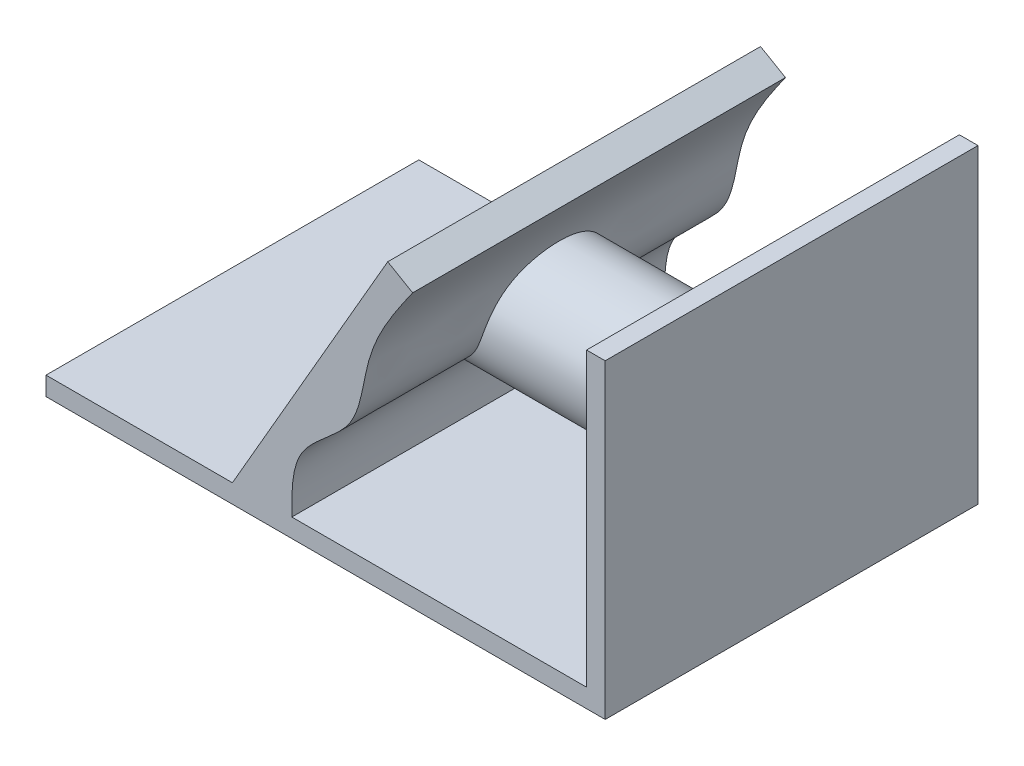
ISO-10303-21;
HEADER;
FILE_DESCRIPTION(('STEP AP214'),'2;1');
FILE_NAME('part.step','',(''),(''),'','','');
FILE_SCHEMA(('AUTOMOTIVE_DESIGN { 1 0 10303 214 1 1 1 1 }'));
ENDSEC;
DATA;
#1=APPLICATION_CONTEXT('core data for automotive mechanical design processes');
#2=APPLICATION_PROTOCOL_DEFINITION('international standard','automotive_design',2000,#1);
#3=PRODUCT_CONTEXT('',#1,'mechanical');
#4=PRODUCT('Part','Part','',(#3));
#5=PRODUCT_RELATED_PRODUCT_CATEGORY('part','',(#4));
#6=PRODUCT_DEFINITION_FORMATION('','',#4);
#7=PRODUCT_DEFINITION_CONTEXT('part definition',#1,'design');
#8=PRODUCT_DEFINITION('design','',#6,#7);
#9=PRODUCT_DEFINITION_SHAPE('','',#8);
#10=(LENGTH_UNIT() NAMED_UNIT(*) SI_UNIT(.MILLI.,.METRE.));
#11=(NAMED_UNIT(*) PLANE_ANGLE_UNIT() SI_UNIT($,.RADIAN.));
#12=(NAMED_UNIT(*) SI_UNIT($,.STERADIAN.) SOLID_ANGLE_UNIT());
#13=UNCERTAINTY_MEASURE_WITH_UNIT(LENGTH_MEASURE(1.E-05),#10,'distance_accuracy_value','');
#14=(GEOMETRIC_REPRESENTATION_CONTEXT(3) GLOBAL_UNCERTAINTY_ASSIGNED_CONTEXT((#13)) GLOBAL_UNIT_ASSIGNED_CONTEXT((#10,
#11,#12)) REPRESENTATION_CONTEXT('',''));
#15=CARTESIAN_POINT('',(0.,0.,0.));
#16=DIRECTION('',(0.,0.,1.));
#17=DIRECTION('',(1.,0.,0.));
#18=AXIS2_PLACEMENT_3D('',#15,#16,#17);
#19=CARTESIAN_POINT('',(-3.,0.,30.));
#20=DIRECTION('',(-1.,0.,0.));
#21=DIRECTION('',(0.,0.,1.));
#22=AXIS2_PLACEMENT_3D('',#19,#20,#21);
#23=PLANE('',#22);
#24=DIRECTION('',(0.,1.,0.));
#25=VECTOR('',#24,1.);
#26=CARTESIAN_POINT('',(-3.,0.,-30.));
#27=LINE('',#26,#25);
#28=CARTESIAN_POINT('',(-3.,3.,-30.));
#29=VERTEX_POINT('',#28);
#30=CARTESIAN_POINT('',(-3.,50.,-30.));
#31=VERTEX_POINT('',#30);
#32=EDGE_CURVE('E193',#29,#31,#27,.T.);
#33=ORIENTED_EDGE('',*,*,#32,.F.);
#34=DIRECTION('',(0.,0.,-1.));
#35=VECTOR('',#34,1.);
#36=CARTESIAN_POINT('',(-3.,3.,30.));
#37=LINE('',#36,#35);
#38=CARTESIAN_POINT('',(-3.,3.,30.));
#39=VERTEX_POINT('',#38);
#40=EDGE_CURVE('E232',#39,#29,#37,.T.);
#41=ORIENTED_EDGE('',*,*,#40,.F.);
#42=DIRECTION('',(0.,1.,0.));
#43=VECTOR('',#42,1.);
#44=CARTESIAN_POINT('',(-3.,0.,30.));
#45=LINE('',#44,#43);
#46=CARTESIAN_POINT('',(-3.,50.,30.));
#47=VERTEX_POINT('',#46);
#48=EDGE_CURVE('E214',#39,#47,#45,.T.);
#49=ORIENTED_EDGE('',*,*,#48,.T.);
#50=DIRECTION('',(0.,0.,-1.));
#51=VECTOR('',#50,1.);
#52=CARTESIAN_POINT('',(-3.,50.,30.));
#53=LINE('',#52,#51);
#54=EDGE_CURVE('E189',#47,#31,#53,.T.);
#55=ORIENTED_EDGE('',*,*,#54,.T.);
#56=EDGE_LOOP('',(#33,#41,#49,#55));
#57=FACE_BOUND('',#56,.T.);
#58=CARTESIAN_POINT('',(-3.,23.,0.));
#59=DIRECTION('',(-1.,0.,0.));
#60=DIRECTION('',(0.,0.,1.));
#61=AXIS2_PLACEMENT_3D('',#58,#59,#60);
#62=CIRCLE('',#61,10.);
#63=CARTESIAN_POINT('',(-3.,23.,10.));
#64=VERTEX_POINT('',#63);
#65=EDGE_CURVE('E123',#64,#64,#62,.T.);
#66=ORIENTED_EDGE('',*,*,#65,.F.);
#67=EDGE_LOOP('',(#66));
#68=FACE_BOUND('',#67,.T.);
#69=ADVANCED_FACE('F33',(#57,#68),#23,.T.);
#70=CARTESIAN_POINT('',(-50.4341854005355,2.99999999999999,30.));
#71=CARTESIAN_POINT('',(-50.4607532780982,6.44708036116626,30.));
#72=CARTESIAN_POINT('',(-50.5185122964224,13.9410917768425,30.));
#73=CARTESIAN_POINT('',(-39.3840702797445,19.5912058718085,30.));
#74=CARTESIAN_POINT('',(-38.7683295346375,32.8752846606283,30.));
#75=CARTESIAN_POINT('',(-33.8355964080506,39.9154113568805,30.));
#76=CARTESIAN_POINT('',(-30.9853236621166,43.9833957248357,30.));
#77=B_SPLINE_CURVE_WITH_KNOTS('',3,(#70,#71,#72,#73,#74,#75,#76),.UNSPECIFIED.,.F.,.F.,(4,1,1,1,
4),(0.,0.207887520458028,0.45195101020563,0.68332178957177,1.),.UNSPECIFIED.);
#78=DIRECTION('',(0.,0.,-1.));
#79=VECTOR('',#78,1.);
#80=SURFACE_OF_LINEAR_EXTRUSION('',#77,#79);
#81=CARTESIAN_POINT('',(-50.4341854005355,2.99999999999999,-30.));
#82=CARTESIAN_POINT('',(-50.4607532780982,6.44708036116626,-30.));
#83=CARTESIAN_POINT('',(-50.5185122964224,13.9410917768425,-30.));
#84=CARTESIAN_POINT('',(-39.3840702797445,19.5912058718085,-30.));
#85=CARTESIAN_POINT('',(-38.7683295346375,32.8752846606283,-30.));
#86=CARTESIAN_POINT('',(-33.8355964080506,39.9154113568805,-30.));
#87=CARTESIAN_POINT('',(-30.9853236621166,43.9833957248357,-30.));
#88=B_SPLINE_CURVE_WITH_KNOTS('',3,(#81,#82,#83,#84,#85,#86,#87),.UNSPECIFIED.,.F.,.F.,(4,1,1,1,
4),(0.,0.207887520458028,0.45195101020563,0.68332178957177,1.),.UNSPECIFIED.);
#89=CARTESIAN_POINT('',(-50.4341854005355,2.99999999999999,-30.));
#90=VERTEX_POINT('',#89);
#91=CARTESIAN_POINT('',(-30.9853236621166,43.9833957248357,-30.));
#92=VERTEX_POINT('',#91);
#93=EDGE_CURVE('E113',#90,#92,#88,.T.);
#94=ORIENTED_EDGE('',*,*,#93,.T.);
#95=DIRECTION('',(0.,0.,-1.));
#96=VECTOR('',#95,1.);
#97=CARTESIAN_POINT('',(-30.9853236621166,43.9833957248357,30.));
#98=LINE('',#97,#96);
#99=CARTESIAN_POINT('',(-30.9853236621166,43.9833957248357,30.));
#100=VERTEX_POINT('',#99);
#101=EDGE_CURVE('E117',#100,#92,#98,.T.);
#102=ORIENTED_EDGE('',*,*,#101,.F.);
#103=CARTESIAN_POINT('',(-50.4341854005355,2.99999999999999,30.));
#104=VERTEX_POINT('',#103);
#105=EDGE_CURVE('E138',#104,#100,#77,.T.);
#106=ORIENTED_EDGE('',*,*,#105,.F.);
#107=DIRECTION('',(0.,0.,-1.));
#108=VECTOR('',#107,1.);
#109=CARTESIAN_POINT('',(-50.4341854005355,2.99999999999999,30.));
#110=LINE('',#109,#108);
#111=EDGE_CURVE('E52',#104,#90,#110,.T.);
#112=ORIENTED_EDGE('',*,*,#111,.T.);
#113=EDGE_LOOP('',(#94,#102,#106,#112));
#114=FACE_BOUND('',#113,.T.);
#115=CARTESIAN_POINT('',(-40.0053458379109,23.,-10.));
#116=CARTESIAN_POINT('',(-39.939909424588,23.174582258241,-10.0000003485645));
#117=CARTESIAN_POINT('',(-39.8778504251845,23.3504236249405,-9.9954228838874));
#118=CARTESIAN_POINT('',(-39.7598051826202,23.7035905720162,-9.97678415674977));
#119=CARTESIAN_POINT('',(-39.703817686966,23.8809158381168,-9.96272485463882));
#120=CARTESIAN_POINT('',(-39.5971710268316,24.2361183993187,-9.92491366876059));
#121=CARTESIAN_POINT('',(-39.5465115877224,24.4139956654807,-9.90116228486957));
#122=CARTESIAN_POINT('',(-39.4496713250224,24.7697797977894,-9.84380097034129));
#123=CARTESIAN_POINT('',(-39.4035000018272,24.9476859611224,-9.81017070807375));
#124=CARTESIAN_POINT('',(-39.3150147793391,25.3023231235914,-9.73304864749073));
#125=CARTESIAN_POINT('',(-39.2727010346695,25.4790540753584,-9.68955645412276));
#126=CARTESIAN_POINT('',(-39.1912324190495,25.8305395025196,-9.59277265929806));
#127=CARTESIAN_POINT('',(-39.1520776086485,26.0052939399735,-9.53948087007));
#128=CARTESIAN_POINT('',(-39.0575229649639,26.4378445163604,-9.39445974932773));
#129=CARTESIAN_POINT('',(-39.0036583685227,26.6939965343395,-9.29675061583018));
#130=CARTESIAN_POINT('',(-38.8995907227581,27.1979896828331,-9.08031535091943));
#131=CARTESIAN_POINT('',(-38.8493875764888,27.4458310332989,-8.96158977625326));
#132=CARTESIAN_POINT('',(-38.7511257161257,27.9310530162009,-8.70402783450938));
#133=CARTESIAN_POINT('',(-38.7030655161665,28.1684408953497,-8.56520569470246));
#134=CARTESIAN_POINT('',(-38.6079231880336,28.6311141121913,-8.26838012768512));
#135=CARTESIAN_POINT('',(-38.560841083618,28.856399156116,-8.11037623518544));
#136=CARTESIAN_POINT('',(-38.4653098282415,29.3008790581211,-7.77045115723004));
#137=CARTESIAN_POINT('',(-38.4168705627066,29.519584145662,-7.58788604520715));
#138=CARTESIAN_POINT('',(-38.3200103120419,29.9406271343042,-7.20477133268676));
#139=CARTESIAN_POINT('',(-38.2715893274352,30.1429645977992,-7.00422125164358));
#140=CARTESIAN_POINT('',(-38.1749474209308,30.5299453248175,-6.58642679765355));
#141=CARTESIAN_POINT('',(-38.1267266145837,30.7145794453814,-6.36917390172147));
#142=CARTESIAN_POINT('',(-38.0550772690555,30.9771442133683,-6.03203788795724));
#143=CARTESIAN_POINT('',(-38.0313051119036,31.0622770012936,-5.91776936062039));
#144=CARTESIAN_POINT('',(-37.9841398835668,31.2276187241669,-5.68564812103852));
#145=CARTESIAN_POINT('',(-37.9607468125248,31.3078276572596,-5.56779540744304));
#146=CARTESIAN_POINT('',(-37.8914060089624,31.5411215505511,-5.20872250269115));
#147=CARTESIAN_POINT('',(-37.8463692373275,31.6866115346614,-4.96232398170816));
#148=CARTESIAN_POINT('',(-37.7604415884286,31.956186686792,-4.45742500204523));
#149=CARTESIAN_POINT('',(-37.7195506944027,32.0802719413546,-4.19892459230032));
#150=CARTESIAN_POINT('',(-37.6434762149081,32.305991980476,-3.67160900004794));
#151=CARTESIAN_POINT('',(-37.6082900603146,32.4076368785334,-3.4027985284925));
#152=CARTESIAN_POINT('',(-37.5449595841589,32.587600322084,-2.85667139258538));
#153=CARTESIAN_POINT('',(-37.5168149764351,32.6659198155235,-2.57935507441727));
#154=CARTESIAN_POINT('',(-37.4694917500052,32.796174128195,-2.02792139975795));
#155=CARTESIAN_POINT('',(-37.4500393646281,32.8489198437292,-1.75401910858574));
#156=CARTESIAN_POINT('',(-37.4194514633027,32.9313768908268,-1.20230649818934));
#157=CARTESIAN_POINT('',(-37.4083157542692,32.9610887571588,-0.924496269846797));
#158=CARTESIAN_POINT('',(-37.3947821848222,32.997154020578,-0.367225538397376));
#159=CARTESIAN_POINT('',(-37.3923819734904,33.0035137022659,-0.0877654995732));
#160=CARTESIAN_POINT('',(-37.3964043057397,32.9928211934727,0.470637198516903));
#161=CARTESIAN_POINT('',(-37.402826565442,32.9757697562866,0.749579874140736));
#162=CARTESIAN_POINT('',(-37.4236827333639,32.9199593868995,1.29007137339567));
#163=CARTESIAN_POINT('',(-37.4376761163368,32.8823930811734,1.5517614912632));
#164=CARTESIAN_POINT('',(-37.4728860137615,32.7867849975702,2.0708665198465));
#165=CARTESIAN_POINT('',(-37.4941022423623,32.7287440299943,2.32828159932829));
#166=CARTESIAN_POINT('',(-37.5430590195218,32.592693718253,2.83718482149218));
#167=CARTESIAN_POINT('',(-37.5708007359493,32.5146807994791,3.08867189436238));
#168=CARTESIAN_POINT('',(-37.6319035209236,32.3393339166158,3.5841183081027));
#169=CARTESIAN_POINT('',(-37.6652648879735,32.2419989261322,3.82807724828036));
#170=CARTESIAN_POINT('',(-37.7373238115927,32.0263758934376,4.31234751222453));
#171=CARTESIAN_POINT('',(-37.7761232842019,31.9076711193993,4.55245802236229));
#172=CARTESIAN_POINT('',(-37.8572004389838,31.6516821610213,5.02194077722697));
#173=CARTESIAN_POINT('',(-37.8994781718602,31.514397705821,5.25131286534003));
#174=CARTESIAN_POINT('',(-37.9860825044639,31.2221017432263,5.69809744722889));
#175=CARTESIAN_POINT('',(-38.0304093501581,31.0670881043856,5.9155084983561));
#176=CARTESIAN_POINT('',(-38.1198326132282,30.7402637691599,6.33714944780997));
#177=CARTESIAN_POINT('',(-38.1649290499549,30.5684526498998,6.54137901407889));
#178=CARTESIAN_POINT('',(-38.2580060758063,30.1986331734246,6.9468905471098));
#179=CARTESIAN_POINT('',(-38.3060019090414,29.999682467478,7.14731075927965));
#180=CARTESIAN_POINT('',(-38.4020086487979,29.5855467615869,7.53061643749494));
#181=CARTESIAN_POINT('',(-38.4500195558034,29.3703611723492,7.71350126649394));
#182=CARTESIAN_POINT('',(-38.5462821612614,28.9253327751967,8.06039838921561));
#183=CARTESIAN_POINT('',(-38.5945338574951,28.6954901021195,8.22441085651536));
#184=CARTESIAN_POINT('',(-38.6919834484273,28.2229060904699,8.53233777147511));
#185=CARTESIAN_POINT('',(-38.7411813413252,27.9801647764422,8.67625225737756));
#186=CARTESIAN_POINT('',(-38.8422699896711,27.480974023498,8.94438513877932));
#187=CARTESIAN_POINT('',(-38.8941845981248,27.2244022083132,9.06836683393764));
#188=CARTESIAN_POINT('',(-39.0018992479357,26.7022998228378,9.29375164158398));
#189=CARTESIAN_POINT('',(-39.0576993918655,26.4367690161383,9.39515415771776));
#190=CARTESIAN_POINT('',(-39.1753819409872,25.8989648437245,9.57478196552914));
#191=CARTESIAN_POINT('',(-39.2372705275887,25.6266848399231,9.6529833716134));
#192=CARTESIAN_POINT('',(-39.3695815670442,25.0784421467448,9.78568376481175));
#193=CARTESIAN_POINT('',(-39.4400036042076,24.8024796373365,9.84018390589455));
#194=CARTESIAN_POINT('',(-39.5911559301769,24.253505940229,9.92496130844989));
#195=CARTESIAN_POINT('',(-39.6717430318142,23.9805020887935,9.95553913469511));
#196=CARTESIAN_POINT('',(-39.846605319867,23.4372546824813,9.99414672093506));
#197=CARTESIAN_POINT('',(-39.940881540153,23.1670113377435,10.0021747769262));
#198=CARTESIAN_POINT('',(-40.1451771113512,22.6341541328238,9.99683687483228));
#199=CARTESIAN_POINT('',(-40.2551186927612,22.3715098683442,9.98357346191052));
#200=CARTESIAN_POINT('',(-40.4335067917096,21.9852019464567,9.94921873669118));
#201=CARTESIAN_POINT('',(-40.4952143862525,21.85771096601,9.93535755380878));
#202=CARTESIAN_POINT('',(-40.6233137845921,21.6056929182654,9.90313231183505));
#203=CARTESIAN_POINT('',(-40.6897050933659,21.4811655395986,9.88476872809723));
#204=CARTESIAN_POINT('',(-40.8397688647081,21.2132621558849,9.84018242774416));
#205=CARTESIAN_POINT('',(-40.9243945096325,21.0705528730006,9.81313887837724));
#206=CARTESIAN_POINT('',(-41.0564645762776,20.8605572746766,9.76872107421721));
#207=CARTESIAN_POINT('',(-41.1013465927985,20.7912319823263,9.75327181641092));
#208=CARTESIAN_POINT('',(-41.1928069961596,20.6539901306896,9.72117293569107));
#209=CARTESIAN_POINT('',(-41.2393854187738,20.586073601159,9.70452328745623));
#210=CARTESIAN_POINT('',(-41.3814219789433,20.3843947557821,9.65286892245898));
#211=CARTESIAN_POINT('',(-41.4791909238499,20.2526881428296,9.61615557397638));
#212=CARTESIAN_POINT('',(-41.6805046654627,19.9935429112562,9.53832546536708));
#213=CARTESIAN_POINT('',(-41.7840860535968,19.8661419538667,9.49717883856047));
#214=CARTESIAN_POINT('',(-41.995380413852,19.6161729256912,9.41101464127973));
#215=CARTESIAN_POINT('',(-42.1030935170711,19.4936050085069,9.36599694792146));
#216=CARTESIAN_POINT('',(-42.3217578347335,19.252846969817,9.27229806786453));
#217=CARTESIAN_POINT('',(-42.432709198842,19.1346570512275,9.22361671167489));
#218=CARTESIAN_POINT('',(-42.770554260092,18.7845424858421,9.07166304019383));
#219=CARTESIAN_POINT('',(-43.0011732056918,18.558536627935,8.96299258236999));
#220=CARTESIAN_POINT('',(-43.4667701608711,18.1185603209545,8.73117251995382));
#221=CARTESIAN_POINT('',(-43.7017509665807,17.9045979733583,8.60801333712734));
#222=CARTESIAN_POINT('',(-44.1714275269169,17.4855204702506,8.34575950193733));
#223=CARTESIAN_POINT('',(-44.4061224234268,17.2804181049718,8.20664280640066));
#224=CARTESIAN_POINT('',(-44.8685972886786,16.8785890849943,7.9113872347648));
#225=CARTESIAN_POINT('',(-45.0964134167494,16.6818149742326,7.75537049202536));
#226=CARTESIAN_POINT('',(-45.5416600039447,16.294423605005,7.42295743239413));
#227=CARTESIAN_POINT('',(-45.7591036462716,16.1037986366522,7.24658801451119));
#228=CARTESIAN_POINT('',(-46.1783886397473,15.7291595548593,6.87059750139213));
#229=CARTESIAN_POINT('',(-46.3802575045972,15.5451341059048,6.67101904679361));
#230=CARTESIAN_POINT('',(-46.7042622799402,15.2411550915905,6.3116783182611));
#231=CARTESIAN_POINT('',(-46.8317714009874,15.1189628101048,6.15864954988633));
#232=CARTESIAN_POINT('',(-47.0753914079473,14.8798839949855,5.83981270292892));
#233=CARTESIAN_POINT('',(-47.1915017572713,14.7629977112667,5.67400402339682));
#234=CARTESIAN_POINT('',(-47.4108694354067,14.5362175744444,5.32980395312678));
#235=CARTESIAN_POINT('',(-47.5141370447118,14.4263181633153,5.15142280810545));
#236=CARTESIAN_POINT('',(-47.7070226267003,14.2152096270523,4.78253121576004));
#237=CARTESIAN_POINT('',(-47.7966409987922,14.1140002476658,4.59202112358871));
#238=CARTESIAN_POINT('',(-47.9622036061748,13.9216928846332,4.19909254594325));
#239=CARTESIAN_POINT('',(-48.038087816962,13.8306399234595,3.99662668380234));
#240=CARTESIAN_POINT('',(-48.175844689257,13.6608574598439,3.58198340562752));
#241=CARTESIAN_POINT('',(-48.2377167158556,13.582128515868,3.36980555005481));
#242=CARTESIAN_POINT('',(-48.3480330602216,13.4383647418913,2.93720038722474));
#243=CARTESIAN_POINT('',(-48.3964623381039,13.3733452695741,2.7167641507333));
#244=CARTESIAN_POINT('',(-48.4805372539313,13.2582362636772,2.26965401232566));
#245=CARTESIAN_POINT('',(-48.5161830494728,13.2081465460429,2.04298018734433));
#246=CARTESIAN_POINT('',(-48.5740068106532,13.1257362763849,1.59624503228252));
#247=CARTESIAN_POINT('',(-48.5967519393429,13.09267455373,1.37639285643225));
#248=CARTESIAN_POINT('',(-48.6318614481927,13.0412409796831,0.934167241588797));
#249=CARTESIAN_POINT('',(-48.6442262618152,13.0228685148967,0.711793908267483));
#250=CARTESIAN_POINT('',(-48.6588899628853,13.0010478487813,0.266000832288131));
#251=CARTESIAN_POINT('',(-48.6611894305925,12.9975987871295,0.0425811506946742));
#252=CARTESIAN_POINT('',(-48.6557848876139,13.0056647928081,-0.403874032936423));
#253=CARTESIAN_POINT('',(-48.6480804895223,13.0171804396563,-0.626909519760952));
#254=CARTESIAN_POINT('',(-48.6219344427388,13.0558209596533,-1.08037250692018));
#255=CARTESIAN_POINT('',(-48.6030598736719,13.083574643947,-1.31072199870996));
#256=CARTESIAN_POINT('',(-48.5537453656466,13.154768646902,-1.7677393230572));
#257=CARTESIAN_POINT('',(-48.5233051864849,13.198209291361,-1.99440707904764));
#258=CARTESIAN_POINT('',(-48.450189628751,13.300092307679,-2.44223123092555));
#259=CARTESIAN_POINT('',(-48.4075198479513,13.3585278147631,-2.66339009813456));
#260=CARTESIAN_POINT('',(-48.3091992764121,13.4894468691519,-3.09854762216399));
#261=CARTESIAN_POINT('',(-48.2535490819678,13.5619297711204,-3.31254660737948));
#262=CARTESIAN_POINT('',(-48.1300376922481,13.7179061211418,-3.72701875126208));
#263=CARTESIAN_POINT('',(-48.0624760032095,13.8011184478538,-3.92768698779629));
#264=CARTESIAN_POINT('',(-47.9140559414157,13.9782776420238,-4.31910591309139));
#265=CARTESIAN_POINT('',(-47.8331982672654,14.0722239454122,-4.5098571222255));
#266=CARTESIAN_POINT('',(-47.6583849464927,14.2691107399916,-4.88011302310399));
#267=CARTESIAN_POINT('',(-47.5644418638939,14.3720425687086,-5.05962826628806));
#268=CARTESIAN_POINT('',(-47.3640005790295,14.5852876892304,-5.40686150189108));
#269=CARTESIAN_POINT('',(-47.2575010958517,14.6956017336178,-5.57457828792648));
#270=CARTESIAN_POINT('',(-46.9992214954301,14.9560544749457,-5.94649689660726));
#271=CARTESIAN_POINT('',(-46.8434491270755,15.1082024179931,-6.14652568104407));
#272=CARTESIAN_POINT('',(-46.5154448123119,15.4195118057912,-6.52661019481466));
#273=CARTESIAN_POINT('',(-46.3432062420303,15.5786760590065,-6.70665782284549));
#274=CARTESIAN_POINT('',(-45.984876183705,15.9030751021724,-7.04908470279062));
#275=CARTESIAN_POINT('',(-45.7987155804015,16.0683377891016,-7.21136438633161));
#276=CARTESIAN_POINT('',(-45.4169445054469,16.4033924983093,-7.51907751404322));
#277=CARTESIAN_POINT('',(-45.2213347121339,16.5731841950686,-7.66451216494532));
#278=CARTESIAN_POINT('',(-44.8377912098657,16.905607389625,-7.93098640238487));
#279=CARTESIAN_POINT('',(-44.6502646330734,17.0679199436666,-8.05301804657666));
#280=CARTESIAN_POINT('',(-44.2724418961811,17.3975054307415,-8.28569635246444));
#281=CARTESIAN_POINT('',(-44.082144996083,17.5647797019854,-8.39633990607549));
#282=CARTESIAN_POINT('',(-43.701210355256,17.9055922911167,-8.60739303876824));
#283=CARTESIAN_POINT('',(-43.5105724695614,18.0791348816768,-8.70779545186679));
#284=CARTESIAN_POINT('',(-43.1326553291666,18.4330731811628,-8.89850470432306));
#285=CARTESIAN_POINT('',(-42.9453638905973,18.6134293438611,-8.98886050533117));
#286=CARTESIAN_POINT('',(-42.5760871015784,18.983571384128,-9.16023322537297));
#287=CARTESIAN_POINT('',(-42.3940986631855,19.1733515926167,-9.2412556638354));
#288=CARTESIAN_POINT('',(-42.038693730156,19.5643604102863,-9.3936356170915));
#289=CARTESIAN_POINT('',(-41.8652720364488,19.7655819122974,-9.46499904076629));
#290=CARTESIAN_POINT('',(-41.5789326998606,20.1217482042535,-9.57808977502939));
#291=CARTESIAN_POINT('',(-41.4629472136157,20.2733782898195,-9.6224409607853));
#292=CARTESIAN_POINT('',(-41.2949874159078,20.5063487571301,-9.68442863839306));
#293=CARTESIAN_POINT('',(-41.2400042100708,20.5849259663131,-9.70433457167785));
#294=CARTESIAN_POINT('',(-41.1322895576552,20.743994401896,-9.74254217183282));
#295=CARTESIAN_POINT('',(-41.0795580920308,20.824485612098,-9.76084385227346));
#296=CARTESIAN_POINT('',(-40.9764497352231,20.9873022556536,-9.79571205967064));
#297=CARTESIAN_POINT('',(-40.9260722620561,21.0696272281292,-9.81227901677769));
#298=CARTESIAN_POINT('',(-40.8276206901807,21.2359874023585,-9.84354751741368));
#299=CARTESIAN_POINT('',(-40.7795466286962,21.3200226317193,-9.85824903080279));
#300=CARTESIAN_POINT('',(-40.6388637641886,21.5742866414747,-9.89933184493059));
#301=CARTESIAN_POINT('',(-40.5496500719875,21.7469024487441,-9.92274095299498));
#302=CARTESIAN_POINT('',(-40.3798957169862,22.0973696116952,-9.9607405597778));
#303=CARTESIAN_POINT('',(-40.2993592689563,22.275223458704,-9.97532678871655));
#304=CARTESIAN_POINT('',(-40.1464234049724,22.6349224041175,-9.99495658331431));
#305=CARTESIAN_POINT('',(-40.0740244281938,22.8167677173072,-9.99999963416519));
#306=CARTESIAN_POINT('',(-40.0053458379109,23.,-10.));
#307=B_SPLINE_CURVE_WITH_KNOTS('',3,(#115,#116,#117,#118,#119,#120,#121,#122,#123,#124,#125,
#126,#127,#128,#129,#130,#131,#132,#133,#134,#135,#136,#137,#138,#139,#140,#141,#142,#143,#144,
#145,#146,#147,#148,#149,#150,#151,#152,#153,#154,#155,#156,#157,#158,#159,#160,#161,#162,#163,
#164,#165,#166,#167,#168,#169,#170,#171,#172,#173,#174,#175,#176,#177,#178,#179,#180,#181,#182,
#183,#184,#185,#186,#187,#188,#189,#190,#191,#192,#193,#194,#195,#196,#197,#198,#199,#200,#201,
#202,#203,#204,#205,#206,#207,#208,#209,#210,#211,#212,#213,#214,#215,#216,#217,#218,#219,#220,
#221,#222,#223,#224,#225,#226,#227,#228,#229,#230,#231,#232,#233,#234,#235,#236,#237,#238,#239,
#240,#241,#242,#243,#244,#245,#246,#247,#248,#249,#250,#251,#252,#253,#254,#255,#256,#257,#258,
#259,#260,#261,#262,#263,#264,#265,#266,#267,#268,#269,#270,#271,#272,#273,#274,#275,#276,#277,
#278,#279,#280,#281,#282,#283,#284,#285,#286,#287,#288,#289,#290,#291,#292,#293,#294,#295,#296,
#297,#298,#299,#300,#301,#302,#303,#304,#305,#306),.UNSPECIFIED.,.T.,.F.,(4,2,2,2,2,2,2,2,2,2,2,
2,2,2,2,2,2,2,2,2,2,2,2,2,2,2,2,2,2,2,2,2,2,2,2,2,2,2,2,2,2,2,2,2,2,2,2,2,2,2,2,2,2,2,2,2,2,2,2,
2,2,2,2,2,2,2,2,2,2,2,2,2,2,2,2,2,2,2,2,2,2,2,2,2,2,2,2,2,2,2,2,2,2,2,2,4),(0.,
0.559231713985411,1.11834784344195,1.6774351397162,2.23768124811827,2.79794980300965,
3.35822909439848,4.19541351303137,5.03257575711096,5.86914820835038,6.70574095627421,
7.57163893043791,8.43756004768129,9.30392599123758,9.73720831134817,10.1704907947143,
11.0383493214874,11.9062043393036,12.773667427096,13.6410952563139,14.4788510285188,
15.3165873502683,16.1540982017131,16.9915821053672,17.7848848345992,18.5781561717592,
19.3715695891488,20.1650251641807,20.976073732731,21.7871341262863,22.5982921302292,
23.4094705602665,24.2678118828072,25.1261843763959,25.9845489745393,26.8429119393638,
27.7108155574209,28.5787420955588,29.4475590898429,30.3163337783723,31.1740094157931,
32.0317498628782,32.8853715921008,33.3121692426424,33.7389218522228,34.2428952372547,
34.4949179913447,34.7469460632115,35.2509480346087,35.7585873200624,36.2662427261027,
36.7739216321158,37.7952697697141,38.8172969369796,39.8407532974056,40.8572528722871,
41.8724240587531,42.8857587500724,43.5862066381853,44.2866874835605,44.9866039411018,
45.6864999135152,46.389384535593,47.092300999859,47.796000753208,48.4996918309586,
49.1694069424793,49.839094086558,50.5087426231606,51.1784170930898,51.8759224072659,
52.5734422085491,53.2706432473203,53.9678122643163,54.6494568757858,55.331065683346,
56.0120244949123,56.6930528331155,57.5786446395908,58.4645942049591,59.3552785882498,
60.2458991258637,61.0748147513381,61.903956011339,62.7336735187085,63.5591516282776,
64.3841390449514,65.2086194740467,65.7962157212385,66.0900102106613,66.3838022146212,
66.6775211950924,66.9712449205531,67.5578695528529,68.144777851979,68.7317178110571),.UNSPECIFIED.);
#308=CARTESIAN_POINT('',(-40.0053458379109,23.,-10.));
#309=VERTEX_POINT('',#308);
#310=EDGE_CURVE('E11',#309,#309,#307,.T.);
#311=ORIENTED_EDGE('',*,*,#310,.F.);
#312=EDGE_LOOP('',(#311));
#313=FACE_BOUND('',#312,.T.);
#314=ADVANCED_FACE('F115',(#114,#313),#80,.F.);
#315=CARTESIAN_POINT('',(0.,3.,30.));
#316=DIRECTION('',(0.,1.,0.));
#317=DIRECTION('',(-1.,0.,0.));
#318=AXIS2_PLACEMENT_3D('',#315,#316,#317);
#319=PLANE('',#318);
#320=DIRECTION('',(1.,0.,0.));
#321=VECTOR('',#320,1.);
#322=CARTESIAN_POINT('',(0.,3.,-30.));
#323=LINE('',#322,#321);
#324=EDGE_CURVE('E197',#90,#29,#323,.T.);
#325=ORIENTED_EDGE('',*,*,#324,.F.);
#326=ORIENTED_EDGE('',*,*,#111,.F.);
#327=DIRECTION('',(1.,0.,0.));
#328=VECTOR('',#327,1.);
#329=CARTESIAN_POINT('',(0.,3.,30.));
#330=LINE('',#329,#328);
#331=EDGE_CURVE('E217',#104,#39,#330,.T.);
#332=ORIENTED_EDGE('',*,*,#331,.T.);
#333=ORIENTED_EDGE('',*,*,#40,.T.);
#334=EDGE_LOOP('',(#325,#326,#332,#333));
#335=FACE_BOUND('',#334,.T.);
#336=ADVANCED_FACE('F156',(#335),#319,.T.);
#337=CARTESIAN_POINT('',(-90.,2.99999999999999,30.));
#338=VERTEX_POINT('',#337);
#339=CARTESIAN_POINT('',(-60.,2.99999999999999,30.));
#340=VERTEX_POINT('',#339);
#341=EDGE_CURVE('E218',#338,#340,#330,.T.);
#342=ORIENTED_EDGE('',*,*,#341,.T.);
#343=DIRECTION('',(0.,0.,-1.));
#344=VECTOR('',#343,1.);
#345=CARTESIAN_POINT('',(-60.,2.99999999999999,30.));
#346=LINE('',#345,#344);
#347=CARTESIAN_POINT('',(-60.,2.99999999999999,-30.));
#348=VERTEX_POINT('',#347);
#349=EDGE_CURVE('E242',#340,#348,#346,.T.);
#350=ORIENTED_EDGE('',*,*,#349,.T.);
#351=CARTESIAN_POINT('',(-90.,2.99999999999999,-30.));
#352=VERTEX_POINT('',#351);
#353=EDGE_CURVE('E201',#352,#348,#323,.T.);
#354=ORIENTED_EDGE('',*,*,#353,.F.);
#355=DIRECTION('',(0.,0.,-1.));
#356=VECTOR('',#355,1.);
#357=CARTESIAN_POINT('',(-90.,2.99999999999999,30.));
#358=LINE('',#357,#356);
#359=EDGE_CURVE('E230',#338,#352,#358,.T.);
#360=ORIENTED_EDGE('',*,*,#359,.F.);
#361=EDGE_LOOP('',(#342,#350,#354,#360));
#362=FACE_BOUND('',#361,.T.);
#363=ADVANCED_FACE('F174',(#362),#319,.T.);
#364=CARTESIAN_POINT('',(0.,0.,30.));
#365=DIRECTION('',(-1.,0.,0.));
#366=DIRECTION('',(0.,0.,1.));
#367=AXIS2_PLACEMENT_3D('',#364,#365,#366);
#368=PLANE('',#367);
#369=DIRECTION('',(0.,1.,0.));
#370=VECTOR('',#369,1.);
#371=CARTESIAN_POINT('',(0.,0.,-30.));
#372=LINE('',#371,#370);
#373=CARTESIAN_POINT('',(0.,0.,-30.));
#374=VERTEX_POINT('',#373);
#375=CARTESIAN_POINT('',(0.,50.,-30.));
#376=VERTEX_POINT('',#375);
#377=EDGE_CURVE('E194',#374,#376,#372,.T.);
#378=ORIENTED_EDGE('',*,*,#377,.T.);
#379=DIRECTION('',(0.,0.,-1.));
#380=VECTOR('',#379,1.);
#381=CARTESIAN_POINT('',(0.,50.,30.));
#382=LINE('',#381,#380);
#383=CARTESIAN_POINT('',(0.,50.,30.));
#384=VERTEX_POINT('',#383);
#385=EDGE_CURVE('E45',#384,#376,#382,.T.);
#386=ORIENTED_EDGE('',*,*,#385,.F.);
#387=DIRECTION('',(0.,1.,0.));
#388=VECTOR('',#387,1.);
#389=CARTESIAN_POINT('',(0.,0.,30.));
#390=LINE('',#389,#388);
#391=CARTESIAN_POINT('',(0.,0.,30.));
#392=VERTEX_POINT('',#391);
#393=EDGE_CURVE('E210',#392,#384,#390,.T.);
#394=ORIENTED_EDGE('',*,*,#393,.F.);
#395=DIRECTION('',(0.,0.,-1.));
#396=VECTOR('',#395,1.);
#397=CARTESIAN_POINT('',(0.,0.,30.));
#398=LINE('',#397,#396);
#399=EDGE_CURVE('E225',#392,#374,#398,.T.);
#400=ORIENTED_EDGE('',*,*,#399,.T.);
#401=EDGE_LOOP('',(#378,#386,#394,#400));
#402=FACE_BOUND('',#401,.T.);
#403=ADVANCED_FACE('F35',(#402),#368,.F.);
#404=CARTESIAN_POINT('',(-3.,50.,30.));
#405=DIRECTION('',(0.,1.,0.));
#406=DIRECTION('',(0.,0.,1.));
#407=AXIS2_PLACEMENT_3D('',#404,#405,#406);
#408=PLANE('',#407);
#409=DIRECTION('',(1.,0.,0.));
#410=VECTOR('',#409,1.);
#411=CARTESIAN_POINT('',(-3.,50.,-30.));
#412=LINE('',#411,#410);
#413=EDGE_CURVE('E186',#31,#376,#412,.T.);
#414=ORIENTED_EDGE('',*,*,#413,.F.);
#415=ORIENTED_EDGE('',*,*,#54,.F.);
#416=DIRECTION('',(1.,0.,0.));
#417=VECTOR('',#416,1.);
#418=CARTESIAN_POINT('',(-3.,50.,30.));
#419=LINE('',#418,#417);
#420=EDGE_CURVE('E212',#47,#384,#419,.T.);
#421=ORIENTED_EDGE('',*,*,#420,.T.);
#422=ORIENTED_EDGE('',*,*,#385,.T.);
#423=EDGE_LOOP('',(#414,#415,#421,#422));
#424=FACE_BOUND('',#423,.T.);
#425=ADVANCED_FACE('F170',(#424),#408,.T.);
#426=CARTESIAN_POINT('',(-90.,0.,30.));
#427=DIRECTION('',(-1.,0.,0.));
#428=DIRECTION('',(0.,0.,1.));
#429=AXIS2_PLACEMENT_3D('',#426,#427,#428);
#430=PLANE('',#429);
#431=DIRECTION('',(0.,1.,0.));
#432=VECTOR('',#431,1.);
#433=CARTESIAN_POINT('',(-90.,0.,-30.));
#434=LINE('',#433,#432);
#435=CARTESIAN_POINT('',(-90.,0.,-30.));
#436=VERTEX_POINT('',#435);
#437=EDGE_CURVE('E205',#436,#352,#434,.T.);
#438=ORIENTED_EDGE('',*,*,#437,.F.);
#439=DIRECTION('',(0.,0.,-1.));
#440=VECTOR('',#439,1.);
#441=CARTESIAN_POINT('',(-90.,0.,30.));
#442=LINE('',#441,#440);
#443=CARTESIAN_POINT('',(-90.,0.,30.));
#444=VERTEX_POINT('',#443);
#445=EDGE_CURVE('E228',#444,#436,#442,.T.);
#446=ORIENTED_EDGE('',*,*,#445,.F.);
#447=DIRECTION('',(0.,1.,0.));
#448=VECTOR('',#447,1.);
#449=CARTESIAN_POINT('',(-90.,0.,30.));
#450=LINE('',#449,#448);
#451=EDGE_CURVE('E221',#444,#338,#450,.T.);
#452=ORIENTED_EDGE('',*,*,#451,.T.);
#453=ORIENTED_EDGE('',*,*,#359,.T.);
#454=EDGE_LOOP('',(#438,#446,#452,#453));
#455=FACE_BOUND('',#454,.T.);
#456=ADVANCED_FACE('F166',(#455),#430,.T.);
#457=CARTESIAN_POINT('',(0.,0.,30.));
#458=DIRECTION('',(0.,1.,0.));
#459=DIRECTION('',(-1.,0.,0.));
#460=AXIS2_PLACEMENT_3D('',#457,#458,#459);
#461=PLANE('',#460);
#462=DIRECTION('',(1.,0.,0.));
#463=VECTOR('',#462,1.);
#464=CARTESIAN_POINT('',(0.,0.,-30.));
#465=LINE('',#464,#463);
#466=EDGE_CURVE('E208',#436,#374,#465,.T.);
#467=ORIENTED_EDGE('',*,*,#466,.T.);
#468=ORIENTED_EDGE('',*,*,#399,.F.);
#469=DIRECTION('',(1.,0.,0.));
#470=VECTOR('',#469,1.);
#471=CARTESIAN_POINT('',(0.,0.,30.));
#472=LINE('',#471,#470);
#473=EDGE_CURVE('E60',#444,#392,#472,.T.);
#474=ORIENTED_EDGE('',*,*,#473,.F.);
#475=ORIENTED_EDGE('',*,*,#445,.T.);
#476=EDGE_LOOP('',(#467,#468,#474,#475));
#477=FACE_BOUND('',#476,.T.);
#478=ADVANCED_FACE('F163',(#477),#461,.F.);
#479=CARTESIAN_POINT('',(0.,50.,30.));
#480=DIRECTION('',(0.,0.,-1.));
#481=DIRECTION('',(-1.,0.,0.));
#482=AXIS2_PLACEMENT_3D('',#479,#480,#481);
#483=PLANE('',#482);
#484=ORIENTED_EDGE('',*,*,#393,.T.);
#485=ORIENTED_EDGE('',*,*,#420,.F.);
#486=ORIENTED_EDGE('',*,*,#48,.F.);
#487=ORIENTED_EDGE('',*,*,#331,.F.);
#488=ORIENTED_EDGE('',*,*,#105,.T.);
#489=DIRECTION('',(-0.86602540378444,0.499999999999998,0.));
#490=VECTOR('',#489,1.);
#491=CARTESIAN_POINT('',(-35.0000000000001,46.301270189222,30.));
#492=LINE('',#491,#490);
#493=CARTESIAN_POINT('',(-35.0000000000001,46.301270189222,30.));
#494=VERTEX_POINT('',#493);
#495=EDGE_CURVE('E129',#100,#494,#492,.T.);
#496=ORIENTED_EDGE('',*,*,#495,.T.);
#497=DIRECTION('',(-0.499999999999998,-0.86602540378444,0.));
#498=VECTOR('',#497,1.);
#499=CARTESIAN_POINT('',(-60.,2.99999999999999,30.));
#500=LINE('',#499,#498);
#501=EDGE_CURVE('E244',#494,#340,#500,.T.);
#502=ORIENTED_EDGE('',*,*,#501,.T.);
#503=ORIENTED_EDGE('',*,*,#341,.F.);
#504=ORIENTED_EDGE('',*,*,#451,.F.);
#505=ORIENTED_EDGE('',*,*,#473,.T.);
#506=EDGE_LOOP('',(#484,#485,#486,#487,#488,#496,#502,#503,#504,#505));
#507=FACE_BOUND('',#506,.T.);
#508=ADVANCED_FACE('F160',(#507),#483,.F.);
#509=CARTESIAN_POINT('',(0.,50.,-30.));
#510=DIRECTION('',(0.,0.,-1.));
#511=DIRECTION('',(-1.,0.,0.));
#512=AXIS2_PLACEMENT_3D('',#509,#510,#511);
#513=PLANE('',#512);
#514=ORIENTED_EDGE('',*,*,#377,.F.);
#515=ORIENTED_EDGE('',*,*,#466,.F.);
#516=ORIENTED_EDGE('',*,*,#437,.T.);
#517=ORIENTED_EDGE('',*,*,#353,.T.);
#518=DIRECTION('',(-0.499999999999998,-0.86602540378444,0.));
#519=VECTOR('',#518,1.);
#520=CARTESIAN_POINT('',(-60.,2.99999999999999,-30.));
#521=LINE('',#520,#519);
#522=CARTESIAN_POINT('',(-35.0000000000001,46.301270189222,-30.));
#523=VERTEX_POINT('',#522);
#524=EDGE_CURVE('E136',#523,#348,#521,.T.);
#525=ORIENTED_EDGE('',*,*,#524,.F.);
#526=DIRECTION('',(-0.86602540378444,0.499999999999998,0.));
#527=VECTOR('',#526,1.);
#528=CARTESIAN_POINT('',(-35.0000000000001,46.301270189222,-30.));
#529=LINE('',#528,#527);
#530=EDGE_CURVE('E122',#92,#523,#529,.T.);
#531=ORIENTED_EDGE('',*,*,#530,.F.);
#532=ORIENTED_EDGE('',*,*,#93,.F.);
#533=ORIENTED_EDGE('',*,*,#324,.T.);
#534=ORIENTED_EDGE('',*,*,#32,.T.);
#535=ORIENTED_EDGE('',*,*,#413,.T.);
#536=EDGE_LOOP('',(#514,#515,#516,#517,#525,#531,#532,#533,#534,#535));
#537=FACE_BOUND('',#536,.T.);
#538=ADVANCED_FACE('F134',(#537),#513,.T.);
#539=CARTESIAN_POINT('',(-35.0000000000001,46.301270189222,30.));
#540=DIRECTION('',(-0.499999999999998,-0.86602540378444,0.));
#541=DIRECTION('',(0.86602540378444,-0.499999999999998,0.));
#542=AXIS2_PLACEMENT_3D('',#539,#540,#541);
#543=PLANE('',#542);
#544=ORIENTED_EDGE('',*,*,#530,.T.);
#545=DIRECTION('',(0.,0.,-1.));
#546=VECTOR('',#545,1.);
#547=CARTESIAN_POINT('',(-35.0000000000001,46.301270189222,30.));
#548=LINE('',#547,#546);
#549=EDGE_CURVE('E130',#494,#523,#548,.T.);
#550=ORIENTED_EDGE('',*,*,#549,.F.);
#551=ORIENTED_EDGE('',*,*,#495,.F.);
#552=ORIENTED_EDGE('',*,*,#101,.T.);
#553=EDGE_LOOP('',(#544,#550,#551,#552));
#554=FACE_BOUND('',#553,.T.);
#555=ADVANCED_FACE('F126',(#554),#543,.F.);
#556=CARTESIAN_POINT('',(-60.,2.99999999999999,30.));
#557=DIRECTION('',(0.86602540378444,-0.499999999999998,0.));
#558=DIRECTION('',(0.499999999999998,0.86602540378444,0.));
#559=AXIS2_PLACEMENT_3D('',#556,#557,#558);
#560=PLANE('',#559);
#561=ORIENTED_EDGE('',*,*,#524,.T.);
#562=ORIENTED_EDGE('',*,*,#349,.F.);
#563=ORIENTED_EDGE('',*,*,#501,.F.);
#564=ORIENTED_EDGE('',*,*,#549,.T.);
#565=EDGE_LOOP('',(#561,#562,#563,#564));
#566=FACE_BOUND('',#565,.T.);
#567=ADVANCED_FACE('F249',(#566),#560,.F.);
#568=CARTESIAN_POINT('',(-90.001,23.,0.));
#569=DIRECTION('',(1.,0.,0.));
#570=DIRECTION('',(0.,0.,-1.));
#571=AXIS2_PLACEMENT_3D('',#568,#569,#570);
#572=CYLINDRICAL_SURFACE('',#571,10.);
#573=ORIENTED_EDGE('',*,*,#65,.T.);
#574=EDGE_LOOP('',(#573));
#575=FACE_BOUND('',#574,.T.);
#576=ORIENTED_EDGE('',*,*,#310,.T.);
#577=EDGE_LOOP('',(#576));
#578=FACE_BOUND('',#577,.T.);
#579=ADVANCED_FACE('F316',(#575,#578),#572,.T.);
#580=CLOSED_SHELL('',(#69,#314,#336,#363,#403,#425,#456,#478,#508,#538,#555,#567,#579));
#581=MANIFOLD_SOLID_BREP('B2',#580);
#582=ADVANCED_BREP_SHAPE_REPRESENTATION('',(#18,#581),#14);
#583=SHAPE_DEFINITION_REPRESENTATION(#9,#582);
ENDSEC;
END-ISO-10303-21;
